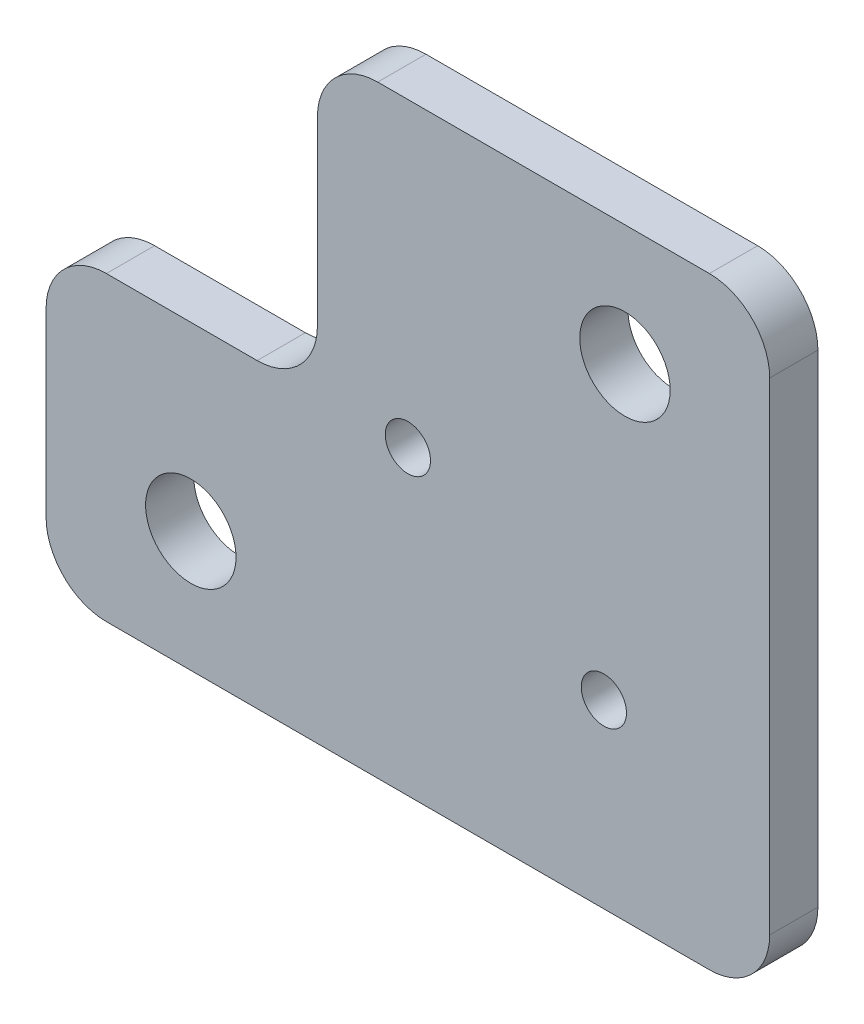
from build123d import *

# Parameters (mm, degrees)
SKETCH_1_W          = 12
SKETCH_1_H          = 10
EXTRUDE_1_DEPTH     = 0.8
CUT_EXTRUDE_1_REACH = 9.851
SKETCH_2_R          = 0.375
SKETCH_2_R_2        = 0.75
SKETCH_2_W          = 4.5
SKETCH_2_H          = 5
FILLET_1_R          = 1


with BuildPart() as part:
    # Sketch 1 → Extrude 1 (new body)
    with BuildSketch(Plane.XY):
        Rectangle(SKETCH_1_W, SKETCH_1_H)
    extrude(amount=EXTRUDE_1_DEPTH)

    # Sketch 2 → Cut-Extrude 1 (cut, up to next)
    with BuildSketch(Plane.XY.offset(0.8), mode=Mode.PRIVATE) as cut_extrude_1_sk1:
        Circle(SKETCH_2_R)
    cut_extrude_1_tool1 = extrude(cut_extrude_1_sk1.sketch, amount=-CUT_EXTRUDE_1_REACH, mode=Mode.PRIVATE) & part.part
    # Sketch 2 → Cut-Extrude 1 (cut, up to next)
    with BuildSketch(Plane.XY.offset(0.8), mode=Mode.PRIVATE) as cut_extrude_1_sk2:
        with Locations((-3.6, -3)):
            Circle(SKETCH_2_R_2)
    cut_extrude_1_tool2 = extrude(cut_extrude_1_sk2.sketch, amount=-CUT_EXTRUDE_1_REACH, mode=Mode.PRIVATE) & part.part
    # Sketch 2 → Cut-Extrude 1 (cut, up to next)
    with BuildSketch(Plane.XY.offset(0.8), mode=Mode.PRIVATE) as cut_extrude_1_sk3:
        with Locations((3.6, 3)):
            Circle(SKETCH_2_R_2)
    cut_extrude_1_tool3 = extrude(cut_extrude_1_sk3.sketch, amount=-CUT_EXTRUDE_1_REACH, mode=Mode.PRIVATE) & part.part
    # Sketch 2 → Cut-Extrude 1 (cut, up to next)
    with BuildSketch(Plane.XY.offset(0.8), mode=Mode.PRIVATE) as cut_extrude_1_sk4:
        with Locations((3.25, -2)):
            Circle(SKETCH_2_R)
    cut_extrude_1_tool4 = extrude(cut_extrude_1_sk4.sketch, amount=-CUT_EXTRUDE_1_REACH, mode=Mode.PRIVATE) & part.part
    # Sketch 2 → Cut-Extrude 1 (cut, up to next)
    with BuildSketch(Plane.XY.offset(0.8), mode=Mode.PRIVATE) as cut_extrude_1_sk5:
        with Locations((-3.75, 2.5)):
            Rectangle(SKETCH_2_W, SKETCH_2_H)
    cut_extrude_1_tool5 = extrude(cut_extrude_1_sk5.sketch, amount=-CUT_EXTRUDE_1_REACH, mode=Mode.PRIVATE) & part.part
    add(cut_extrude_1_tool1.solids().sort_by_distance((0, 0, 0.8))[0], mode=Mode.SUBTRACT)
    add(cut_extrude_1_tool2.solids().sort_by_distance((-3.6, -3, 0.8))[0], mode=Mode.SUBTRACT)
    add(cut_extrude_1_tool3.solids().sort_by_distance((3.6, 3, 0.8))[0], mode=Mode.SUBTRACT)
    add(cut_extrude_1_tool4.solids().sort_by_distance((3.25, -2, 0.8))[0], mode=Mode.SUBTRACT)
    add(cut_extrude_1_tool5.solids().sort_by_distance((-3.75, 2.5, 0.8))[0], mode=Mode.SUBTRACT)

    # Fillet 1
    fillet_1_edges = [part.edges().sort_by_distance(p)[0] for p in [
        (-6, 0, 0.4),
        (-1.5, 5, 0.4),
        (-1.5, 0, 0.4),
        (6, -5, 0.4),
        (-6, -5, 0.4),
        (6, 5, 0.4),
    ]]
    fillet(fillet_1_edges, radius=FILLET_1_R)


solid = part.part
